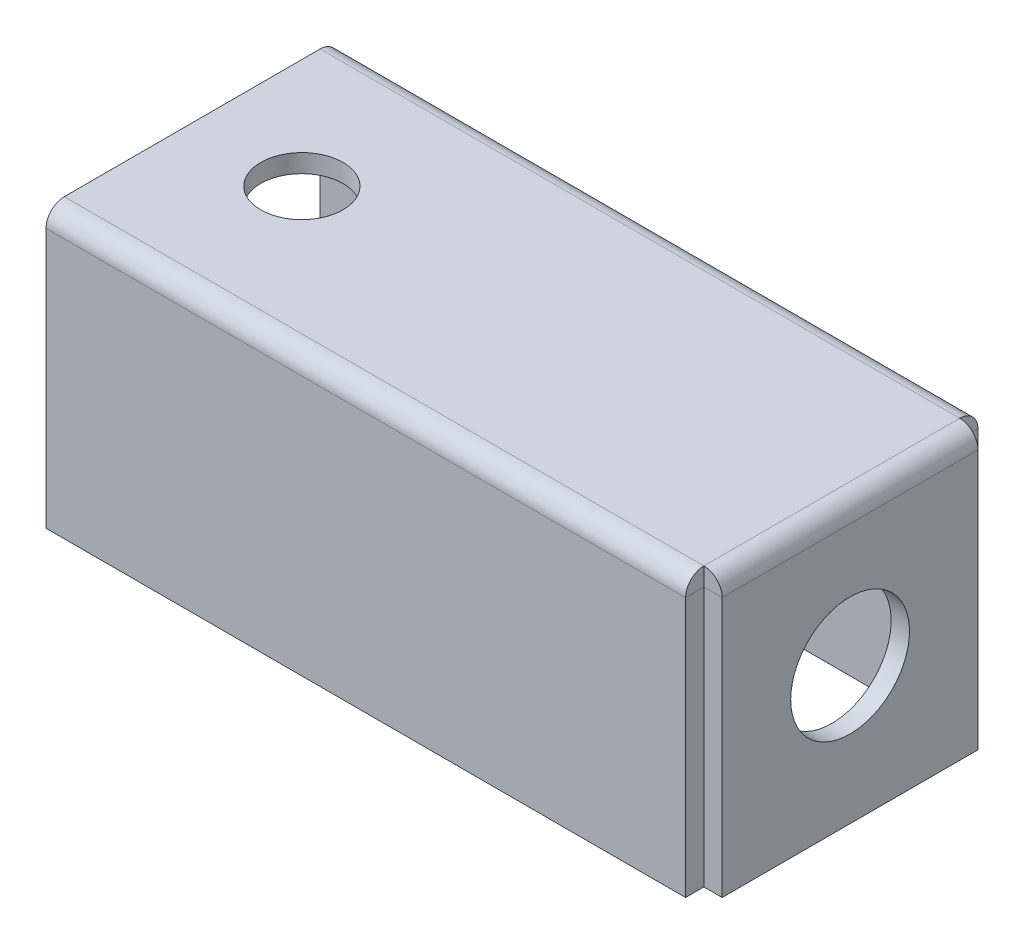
ISO-10303-21;
HEADER;
FILE_DESCRIPTION(('STEP AP214'),'2;1');
FILE_NAME('part.step','',(''),(''),'','','');
FILE_SCHEMA(('AUTOMOTIVE_DESIGN { 1 0 10303 214 1 1 1 1 }'));
ENDSEC;
DATA;
#1=APPLICATION_CONTEXT('core data for automotive mechanical design processes');
#2=APPLICATION_PROTOCOL_DEFINITION('international standard','automotive_design',2000,#1);
#3=PRODUCT_CONTEXT('',#1,'mechanical');
#4=PRODUCT('Part','Part','',(#3));
#5=PRODUCT_RELATED_PRODUCT_CATEGORY('part','',(#4));
#6=PRODUCT_DEFINITION_FORMATION('','',#4);
#7=PRODUCT_DEFINITION_CONTEXT('part definition',#1,'design');
#8=PRODUCT_DEFINITION('design','',#6,#7);
#9=PRODUCT_DEFINITION_SHAPE('','',#8);
#10=(LENGTH_UNIT() NAMED_UNIT(*) SI_UNIT(.MILLI.,.METRE.));
#11=(NAMED_UNIT(*) PLANE_ANGLE_UNIT() SI_UNIT($,.RADIAN.));
#12=(NAMED_UNIT(*) SI_UNIT($,.STERADIAN.) SOLID_ANGLE_UNIT());
#13=UNCERTAINTY_MEASURE_WITH_UNIT(LENGTH_MEASURE(1.E-05),#10,'distance_accuracy_value','');
#14=(GEOMETRIC_REPRESENTATION_CONTEXT(3) GLOBAL_UNCERTAINTY_ASSIGNED_CONTEXT((#13)) GLOBAL_UNIT_ASSIGNED_CONTEXT((#10,
#11,#12)) REPRESENTATION_CONTEXT('',''));
#15=CARTESIAN_POINT('',(0.,0.,0.));
#16=DIRECTION('',(0.,0.,1.));
#17=DIRECTION('',(1.,0.,0.));
#18=AXIS2_PLACEMENT_3D('',#15,#16,#17);
#19=CARTESIAN_POINT('',(0.,-1.,0.));
#20=DIRECTION('',(0.,-1.,0.));
#21=DIRECTION('',(0.,0.,-1.));
#22=AXIS2_PLACEMENT_3D('',#19,#20,#21);
#23=PLANE('',#22);
#24=CARTESIAN_POINT('',(6.,-1.,0.));
#25=DIRECTION('',(0.,1.,0.));
#26=DIRECTION('',(0.,0.,1.));
#27=AXIS2_PLACEMENT_3D('',#24,#25,#26);
#28=CIRCLE('',#27,2.25);
#29=CARTESIAN_POINT('',(6.,-1.,2.25));
#30=VERTEX_POINT('',#29);
#31=EDGE_CURVE('E265',#30,#30,#28,.T.);
#32=ORIENTED_EDGE('',*,*,#31,.T.);
#33=EDGE_LOOP('',(#32));
#34=FACE_BOUND('',#33,.T.);
#35=DIRECTION('',(0.,0.,1.));
#36=VECTOR('',#35,1.);
#37=CARTESIAN_POINT('',(35.,-1.,0.));
#38=LINE('',#37,#36);
#39=CARTESIAN_POINT('',(35.,-1.,-7.));
#40=VERTEX_POINT('',#39);
#41=CARTESIAN_POINT('',(35.,-1.,7.));
#42=VERTEX_POINT('',#41);
#43=EDGE_CURVE('E262',#40,#42,#38,.T.);
#44=ORIENTED_EDGE('',*,*,#43,.T.);
#45=DIRECTION('',(-1.,0.,0.));
#46=VECTOR('',#45,1.);
#47=CARTESIAN_POINT('',(0.,-1.,7.));
#48=LINE('',#47,#46);
#49=CARTESIAN_POINT('',(0.,-1.,7.));
#50=VERTEX_POINT('',#49);
#51=EDGE_CURVE('E322',#42,#50,#48,.T.);
#52=ORIENTED_EDGE('',*,*,#51,.T.);
#53=DIRECTION('',(0.,0.,1.));
#54=VECTOR('',#53,1.);
#55=CARTESIAN_POINT('',(0.,-1.,22.));
#56=LINE('',#55,#54);
#57=CARTESIAN_POINT('',(0.,-1.,-7.));
#58=VERTEX_POINT('',#57);
#59=EDGE_CURVE('E271',#58,#50,#56,.T.);
#60=ORIENTED_EDGE('',*,*,#59,.F.);
#61=DIRECTION('',(-1.,0.,0.));
#62=VECTOR('',#61,1.);
#63=CARTESIAN_POINT('',(0.,-1.,-7.));
#64=LINE('',#63,#62);
#65=EDGE_CURVE('E307',#40,#58,#64,.T.);
#66=ORIENTED_EDGE('',*,*,#65,.F.);
#67=EDGE_LOOP('',(#44,#52,#60,#66));
#68=FACE_BOUND('',#67,.T.);
#69=ADVANCED_FACE('F48',(#34,#68),#23,.T.);
#70=CARTESIAN_POINT('',(0.,-1.,22.));
#71=DIRECTION('',(-1.,0.,0.));
#72=DIRECTION('',(0.,0.,1.));
#73=AXIS2_PLACEMENT_3D('',#70,#71,#72);
#74=PLANE('',#73);
#75=ORIENTED_EDGE('',*,*,#59,.T.);
#76=DIRECTION('',(0.,1.,0.));
#77=VECTOR('',#76,1.);
#78=CARTESIAN_POINT('',(0.,-1.,7.));
#79=LINE('',#78,#77);
#80=CARTESIAN_POINT('',(0.,0.,7.));
#81=VERTEX_POINT('',#80);
#82=EDGE_CURVE('E12',#50,#81,#79,.T.);
#83=ORIENTED_EDGE('',*,*,#82,.T.);
#84=DIRECTION('',(0.,0.,1.));
#85=VECTOR('',#84,1.);
#86=CARTESIAN_POINT('',(0.,0.,22.));
#87=LINE('',#86,#85);
#88=CARTESIAN_POINT('',(0.,0.,-7.));
#89=VERTEX_POINT('',#88);
#90=EDGE_CURVE('E52',#89,#81,#87,.T.);
#91=ORIENTED_EDGE('',*,*,#90,.F.);
#92=DIRECTION('',(0.,1.,0.));
#93=VECTOR('',#92,1.);
#94=CARTESIAN_POINT('',(0.,-1.,-7.));
#95=LINE('',#94,#93);
#96=EDGE_CURVE('E314',#58,#89,#95,.T.);
#97=ORIENTED_EDGE('',*,*,#96,.F.);
#98=EDGE_LOOP('',(#75,#83,#91,#97));
#99=FACE_BOUND('',#98,.T.);
#100=ADVANCED_FACE('F50',(#99),#74,.T.);
#101=CARTESIAN_POINT('',(0.,0.,0.));
#102=DIRECTION('',(0.,-1.,0.));
#103=DIRECTION('',(0.,0.,-1.));
#104=AXIS2_PLACEMENT_3D('',#101,#102,#103);
#105=PLANE('',#104);
#106=DIRECTION('',(-1.,0.,0.));
#107=VECTOR('',#106,1.);
#108=CARTESIAN_POINT('',(0.,0.,7.));
#109=LINE('',#108,#107);
#110=CARTESIAN_POINT('',(35.,0.,7.));
#111=VERTEX_POINT('',#110);
#112=EDGE_CURVE('E57',#111,#81,#109,.T.);
#113=ORIENTED_EDGE('',*,*,#112,.F.);
#114=DIRECTION('',(0.,0.,1.));
#115=VECTOR('',#114,1.);
#116=CARTESIAN_POINT('',(35.,0.,0.));
#117=LINE('',#116,#115);
#118=CARTESIAN_POINT('',(35.,0.,-7.));
#119=VERTEX_POINT('',#118);
#120=EDGE_CURVE('E257',#119,#111,#117,.T.);
#121=ORIENTED_EDGE('',*,*,#120,.F.);
#122=DIRECTION('',(-1.,0.,0.));
#123=VECTOR('',#122,1.);
#124=CARTESIAN_POINT('',(0.,0.,-7.));
#125=LINE('',#124,#123);
#126=EDGE_CURVE('E316',#119,#89,#125,.T.);
#127=ORIENTED_EDGE('',*,*,#126,.T.);
#128=ORIENTED_EDGE('',*,*,#90,.T.);
#129=EDGE_LOOP('',(#113,#121,#127,#128));
#130=FACE_BOUND('',#129,.T.);
#131=CARTESIAN_POINT('',(6.,0.,0.));
#132=DIRECTION('',(0.,1.,0.));
#133=DIRECTION('',(0.,0.,1.));
#134=AXIS2_PLACEMENT_3D('',#131,#132,#133);
#135=CIRCLE('',#134,2.25);
#136=CARTESIAN_POINT('',(6.,0.,2.25));
#137=VERTEX_POINT('',#136);
#138=EDGE_CURVE('E268',#137,#137,#135,.T.);
#139=ORIENTED_EDGE('',*,*,#138,.F.);
#140=EDGE_LOOP('',(#139));
#141=FACE_BOUND('',#140,.T.);
#142=ADVANCED_FACE('F345',(#130,#141),#105,.F.);
#143=CARTESIAN_POINT('',(36.0010000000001,34.7859689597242,0.));
#144=DIRECTION('',(-1.,0.,0.));
#145=DIRECTION('',(0.,0.,-1.));
#146=AXIS2_PLACEMENT_3D('',#143,#144,#145);
#147=PLANE('',#146);
#148=CARTESIAN_POINT('',(36.001,-7.71403104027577,0.));
#149=DIRECTION('',(1.,0.,0.));
#150=DIRECTION('',(0.,0.,1.));
#151=AXIS2_PLACEMENT_3D('',#148,#149,#150);
#152=CIRCLE('',#151,3.25);
#153=CARTESIAN_POINT('',(36.001,-7.71403104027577,3.25));
#154=VERTEX_POINT('',#153);
#155=EDGE_CURVE('E278',#154,#154,#152,.T.);
#156=ORIENTED_EDGE('',*,*,#155,.F.);
#157=EDGE_LOOP('',(#156));
#158=FACE_BOUND('',#157,.T.);
#159=DIRECTION('',(0.,1.,0.));
#160=VECTOR('',#159,1.);
#161=CARTESIAN_POINT('',(36.001,-0.214031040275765,-7.));
#162=LINE('',#161,#160);
#163=CARTESIAN_POINT('',(36.001,-15.2140310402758,-7.));
#164=VERTEX_POINT('',#163);
#165=CARTESIAN_POINT('',(36.001,-1.00100000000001,-7.));
#166=VERTEX_POINT('',#165);
#167=EDGE_CURVE('E289',#164,#166,#162,.T.);
#168=ORIENTED_EDGE('',*,*,#167,.T.);
#169=DIRECTION('',(0.,0.,1.));
#170=VECTOR('',#169,1.);
#171=CARTESIAN_POINT('',(36.001,-1.00100000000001,0.));
#172=LINE('',#171,#170);
#173=CARTESIAN_POINT('',(36.001,-1.00100000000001,7.));
#174=VERTEX_POINT('',#173);
#175=EDGE_CURVE('E301',#166,#174,#172,.T.);
#176=ORIENTED_EDGE('',*,*,#175,.T.);
#177=DIRECTION('',(0.,-1.,0.));
#178=VECTOR('',#177,1.);
#179=CARTESIAN_POINT('',(36.001,-0.214031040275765,7.));
#180=LINE('',#179,#178);
#181=CARTESIAN_POINT('',(36.001,-15.2140310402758,7.));
#182=VERTEX_POINT('',#181);
#183=EDGE_CURVE('E277',#174,#182,#180,.T.);
#184=ORIENTED_EDGE('',*,*,#183,.T.);
#185=DIRECTION('',(0.,0.,-1.));
#186=VECTOR('',#185,1.);
#187=CARTESIAN_POINT('',(36.001,-15.2140310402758,-7.));
#188=LINE('',#187,#186);
#189=EDGE_CURVE('E286',#182,#164,#188,.T.);
#190=ORIENTED_EDGE('',*,*,#189,.T.);
#191=EDGE_LOOP('',(#168,#176,#184,#190));
#192=FACE_BOUND('',#191,.T.);
#193=ADVANCED_FACE('F407',(#158,#192),#147,.F.);
#194=CARTESIAN_POINT('',(35.001,-0.214031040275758,-7.));
#195=DIRECTION('',(0.,0.,-1.));
#196=DIRECTION('',(0.,1.,0.));
#197=AXIS2_PLACEMENT_3D('',#194,#195,#196);
#198=PLANE('',#197);
#199=DIRECTION('',(-1.,0.,0.));
#200=VECTOR('',#199,1.);
#201=CARTESIAN_POINT('',(35.001,-1.001,-7.));
#202=LINE('',#201,#200);
#203=CARTESIAN_POINT('',(35.001,-1.001,-7.));
#204=VERTEX_POINT('',#203);
#205=EDGE_CURVE('E304',#166,#204,#202,.T.);
#206=ORIENTED_EDGE('',*,*,#205,.F.);
#207=ORIENTED_EDGE('',*,*,#167,.F.);
#208=DIRECTION('',(1.,0.,0.));
#209=VECTOR('',#208,1.);
#210=CARTESIAN_POINT('',(35.001,-15.2140310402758,-7.));
#211=LINE('',#210,#209);
#212=CARTESIAN_POINT('',(35.001,-15.2140310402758,-7.));
#213=VERTEX_POINT('',#212);
#214=EDGE_CURVE('E290',#213,#164,#211,.T.);
#215=ORIENTED_EDGE('',*,*,#214,.F.);
#216=DIRECTION('',(0.,1.,0.));
#217=VECTOR('',#216,1.);
#218=CARTESIAN_POINT('',(35.001,-0.214031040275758,-7.));
#219=LINE('',#218,#217);
#220=EDGE_CURVE('E284',#213,#204,#219,.T.);
#221=ORIENTED_EDGE('',*,*,#220,.T.);
#222=EDGE_LOOP('',(#206,#207,#215,#221));
#223=FACE_BOUND('',#222,.T.);
#224=ADVANCED_FACE('F404',(#223),#198,.T.);
#225=CARTESIAN_POINT('',(35.001,-15.2140310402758,-7.));
#226=DIRECTION('',(0.,-1.,0.));
#227=DIRECTION('',(0.,0.,-1.));
#228=AXIS2_PLACEMENT_3D('',#225,#226,#227);
#229=PLANE('',#228);
#230=ORIENTED_EDGE('',*,*,#189,.F.);
#231=DIRECTION('',(1.,0.,0.));
#232=VECTOR('',#231,1.);
#233=CARTESIAN_POINT('',(35.001,-15.2140310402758,7.));
#234=LINE('',#233,#232);
#235=CARTESIAN_POINT('',(35.001,-15.2140310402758,7.));
#236=VERTEX_POINT('',#235);
#237=EDGE_CURVE('E293',#236,#182,#234,.T.);
#238=ORIENTED_EDGE('',*,*,#237,.F.);
#239=DIRECTION('',(0.,0.,-1.));
#240=VECTOR('',#239,1.);
#241=CARTESIAN_POINT('',(35.001,-15.2140310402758,-7.));
#242=LINE('',#241,#240);
#243=EDGE_CURVE('E281',#236,#213,#242,.T.);
#244=ORIENTED_EDGE('',*,*,#243,.T.);
#245=ORIENTED_EDGE('',*,*,#214,.T.);
#246=EDGE_LOOP('',(#230,#238,#244,#245));
#247=FACE_BOUND('',#246,.T.);
#248=ADVANCED_FACE('F415',(#247),#229,.T.);
#249=CARTESIAN_POINT('',(35.001,-0.214031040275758,7.));
#250=DIRECTION('',(0.,0.,1.));
#251=DIRECTION('',(0.,-1.,0.));
#252=AXIS2_PLACEMENT_3D('',#249,#250,#251);
#253=PLANE('',#252);
#254=DIRECTION('',(1.,0.,0.));
#255=VECTOR('',#254,1.);
#256=CARTESIAN_POINT('',(35.001,-1.001,7.));
#257=LINE('',#256,#255);
#258=CARTESIAN_POINT('',(35.001,-1.001,7.));
#259=VERTEX_POINT('',#258);
#260=EDGE_CURVE('E298',#259,#174,#257,.T.);
#261=ORIENTED_EDGE('',*,*,#260,.F.);
#262=DIRECTION('',(0.,-1.,0.));
#263=VECTOR('',#262,1.);
#264=CARTESIAN_POINT('',(35.001,-0.214031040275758,7.));
#265=LINE('',#264,#263);
#266=EDGE_CURVE('E285',#259,#236,#265,.T.);
#267=ORIENTED_EDGE('',*,*,#266,.T.);
#268=ORIENTED_EDGE('',*,*,#237,.T.);
#269=ORIENTED_EDGE('',*,*,#183,.F.);
#270=EDGE_LOOP('',(#261,#267,#268,#269));
#271=FACE_BOUND('',#270,.T.);
#272=ADVANCED_FACE('F420',(#271),#253,.T.);
#273=CARTESIAN_POINT('',(35.0010000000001,34.7859689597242,0.));
#274=DIRECTION('',(-1.,0.,0.));
#275=DIRECTION('',(0.,0.,-1.));
#276=AXIS2_PLACEMENT_3D('',#273,#274,#275);
#277=PLANE('',#276);
#278=DIRECTION('',(0.,0.,1.));
#279=VECTOR('',#278,1.);
#280=CARTESIAN_POINT('',(35.001,-1.001,0.));
#281=LINE('',#280,#279);
#282=EDGE_CURVE('E292',#204,#259,#281,.T.);
#283=ORIENTED_EDGE('',*,*,#282,.F.);
#284=ORIENTED_EDGE('',*,*,#220,.F.);
#285=ORIENTED_EDGE('',*,*,#243,.F.);
#286=ORIENTED_EDGE('',*,*,#266,.F.);
#287=EDGE_LOOP('',(#283,#284,#285,#286));
#288=FACE_BOUND('',#287,.T.);
#289=CARTESIAN_POINT('',(35.001,-7.71403104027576,0.));
#290=DIRECTION('',(1.,0.,0.));
#291=DIRECTION('',(0.,0.,1.));
#292=AXIS2_PLACEMENT_3D('',#289,#290,#291);
#293=CIRCLE('',#292,3.25);
#294=CARTESIAN_POINT('',(35.001,-7.71403104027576,3.25));
#295=VERTEX_POINT('',#294);
#296=EDGE_CURVE('E274',#295,#295,#293,.T.);
#297=ORIENTED_EDGE('',*,*,#296,.T.);
#298=EDGE_LOOP('',(#297));
#299=FACE_BOUND('',#298,.T.);
#300=ADVANCED_FACE('F423',(#288,#299),#277,.T.);
#301=CARTESIAN_POINT('',(35.001,-7.71403104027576,0.));
#302=DIRECTION('',(1.,0.,0.));
#303=DIRECTION('',(0.,0.,1.));
#304=AXIS2_PLACEMENT_3D('',#301,#302,#303);
#305=CYLINDRICAL_SURFACE('',#304,3.25);
#306=ORIENTED_EDGE('',*,*,#296,.F.);
#307=EDGE_LOOP('',(#306));
#308=FACE_BOUND('',#307,.T.);
#309=ORIENTED_EDGE('',*,*,#155,.T.);
#310=EDGE_LOOP('',(#309));
#311=FACE_BOUND('',#310,.T.);
#312=ADVANCED_FACE('F427',(#308,#311),#305,.F.);
#313=CARTESIAN_POINT('',(6.,-1.,0.));
#314=DIRECTION('',(0.,1.,0.));
#315=DIRECTION('',(0.,0.,1.));
#316=AXIS2_PLACEMENT_3D('',#313,#314,#315);
#317=CYLINDRICAL_SURFACE('',#316,2.25);
#318=ORIENTED_EDGE('',*,*,#31,.F.);
#319=EDGE_LOOP('',(#318));
#320=FACE_BOUND('',#319,.T.);
#321=ORIENTED_EDGE('',*,*,#138,.T.);
#322=EDGE_LOOP('',(#321));
#323=FACE_BOUND('',#322,.T.);
#324=ADVANCED_FACE('F434',(#320,#323),#317,.F.);
#325=CARTESIAN_POINT('',(35.,-1.001,-7.));
#326=DIRECTION('',(0.,0.,1.));
#327=DIRECTION('',(1.,0.,0.));
#328=AXIS2_PLACEMENT_3D('',#325,#326,#327);
#329=PLANE('',#328);
#330=DIRECTION('',(0.,1.,0.));
#331=VECTOR('',#330,1.);
#332=CARTESIAN_POINT('',(35.,-1.,-7.));
#333=LINE('',#332,#331);
#334=EDGE_CURVE('E319',#40,#119,#333,.T.);
#335=ORIENTED_EDGE('',*,*,#334,.T.);
#336=CARTESIAN_POINT('',(35.,-1.001,-7.));
#337=DIRECTION('',(0.,0.,1.));
#338=DIRECTION('',(1.,0.,0.));
#339=AXIS2_PLACEMENT_3D('',#336,#337,#338);
#340=CIRCLE('',#339,1.001);
#341=EDGE_CURVE('E246',#119,#166,#340,.F.);
#342=ORIENTED_EDGE('',*,*,#341,.T.);
#343=ORIENTED_EDGE('',*,*,#205,.T.);
#344=CARTESIAN_POINT('',(35.,-1.001,-7.));
#345=DIRECTION('',(0.,0.,-1.));
#346=DIRECTION('',(1.,0.,0.));
#347=AXIS2_PLACEMENT_3D('',#344,#345,#346);
#348=CIRCLE('',#347,0.00100000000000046);
#349=EDGE_CURVE('E250',#40,#204,#348,.T.);
#350=ORIENTED_EDGE('',*,*,#349,.F.);
#351=EDGE_LOOP('',(#335,#342,#343,#350));
#352=FACE_BOUND('',#351,.T.);
#353=ADVANCED_FACE('F363',(#352),#329,.F.);
#354=CARTESIAN_POINT('',(35.,-1.001,7.));
#355=DIRECTION('',(0.,0.,-1.));
#356=DIRECTION('',(-1.,0.,0.));
#357=AXIS2_PLACEMENT_3D('',#354,#355,#356);
#358=PLANE('',#357);
#359=ORIENTED_EDGE('',*,*,#260,.T.);
#360=CARTESIAN_POINT('',(35.,-1.001,7.));
#361=DIRECTION('',(0.,0.,1.));
#362=DIRECTION('',(1.,0.,0.));
#363=AXIS2_PLACEMENT_3D('',#360,#361,#362);
#364=CIRCLE('',#363,1.001);
#365=EDGE_CURVE('E254',#174,#111,#364,.T.);
#366=ORIENTED_EDGE('',*,*,#365,.T.);
#367=DIRECTION('',(0.,1.,0.));
#368=VECTOR('',#367,1.);
#369=CARTESIAN_POINT('',(35.,-1.,7.));
#370=LINE('',#369,#368);
#371=EDGE_CURVE('E325',#42,#111,#370,.T.);
#372=ORIENTED_EDGE('',*,*,#371,.F.);
#373=CARTESIAN_POINT('',(35.,-1.001,7.));
#374=DIRECTION('',(0.,0.,1.));
#375=DIRECTION('',(-1.,0.,0.));
#376=AXIS2_PLACEMENT_3D('',#373,#374,#375);
#377=CIRCLE('',#376,0.00100000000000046);
#378=EDGE_CURVE('E253',#259,#42,#377,.T.);
#379=ORIENTED_EDGE('',*,*,#378,.F.);
#380=EDGE_LOOP('',(#359,#366,#372,#379));
#381=FACE_BOUND('',#380,.T.);
#382=ADVANCED_FACE('F370',(#381),#358,.F.);
#383=CARTESIAN_POINT('',(35.,-1.001,-14.0577139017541));
#384=DIRECTION('',(0.,0.,1.));
#385=DIRECTION('',(1.,0.,0.));
#386=AXIS2_PLACEMENT_3D('',#383,#384,#385);
#387=CYLINDRICAL_SURFACE('',#386,0.001);
#388=ORIENTED_EDGE('',*,*,#378,.T.);
#389=ORIENTED_EDGE('',*,*,#43,.F.);
#390=ORIENTED_EDGE('',*,*,#349,.T.);
#391=ORIENTED_EDGE('',*,*,#282,.T.);
#392=EDGE_LOOP('',(#388,#389,#390,#391));
#393=FACE_BOUND('',#392,.T.);
#394=ADVANCED_FACE('F366',(#393),#387,.F.);
#395=CARTESIAN_POINT('',(35.,-1.001,-14.0577139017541));
#396=DIRECTION('',(0.,0.,1.));
#397=DIRECTION('',(1.,0.,0.));
#398=AXIS2_PLACEMENT_3D('',#395,#396,#397);
#399=CYLINDRICAL_SURFACE('',#398,1.001);
#400=ORIENTED_EDGE('',*,*,#365,.F.);
#401=ORIENTED_EDGE('',*,*,#175,.F.);
#402=ORIENTED_EDGE('',*,*,#341,.F.);
#403=ORIENTED_EDGE('',*,*,#120,.T.);
#404=EDGE_LOOP('',(#400,#401,#402,#403));
#405=FACE_BOUND('',#404,.T.);
#406=ADVANCED_FACE('F443',(#405),#399,.T.);
#407=CARTESIAN_POINT('',(35.,-1.001,-7.));
#408=DIRECTION('',(-1.,0.,0.));
#409=DIRECTION('',(0.,0.,1.));
#410=AXIS2_PLACEMENT_3D('',#407,#408,#409);
#411=PLANE('',#410);
#412=DIRECTION('',(0.,0.,1.));
#413=VECTOR('',#412,1.);
#414=CARTESIAN_POINT('',(35.,-1.001,-7.001));
#415=LINE('',#414,#413);
#416=CARTESIAN_POINT('',(35.,-1.001,-8.001));
#417=VERTEX_POINT('',#416);
#418=CARTESIAN_POINT('',(35.,-1.001,-7.001));
#419=VERTEX_POINT('',#418);
#420=EDGE_CURVE('E215',#417,#419,#415,.T.);
#421=ORIENTED_EDGE('',*,*,#420,.F.);
#422=CARTESIAN_POINT('',(35.,-1.001,-7.));
#423=DIRECTION('',(1.,0.,0.));
#424=DIRECTION('',(0.,0.,-1.));
#425=AXIS2_PLACEMENT_3D('',#422,#423,#424);
#426=CIRCLE('',#425,1.001);
#427=EDGE_CURVE('E72',#417,#119,#426,.T.);
#428=ORIENTED_EDGE('',*,*,#427,.T.);
#429=ORIENTED_EDGE('',*,*,#334,.F.);
#430=CARTESIAN_POINT('',(35.,-1.001,-7.));
#431=DIRECTION('',(1.,0.,0.));
#432=DIRECTION('',(0.,0.,1.));
#433=AXIS2_PLACEMENT_3D('',#430,#431,#432);
#434=CIRCLE('',#433,0.00100000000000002);
#435=EDGE_CURVE('E239',#419,#40,#434,.T.);
#436=ORIENTED_EDGE('',*,*,#435,.F.);
#437=EDGE_LOOP('',(#421,#428,#429,#436));
#438=FACE_BOUND('',#437,.T.);
#439=ADVANCED_FACE('F361',(#438),#411,.F.);
#440=CARTESIAN_POINT('',(0.,-1.001,-7.));
#441=DIRECTION('',(1.,0.,0.));
#442=DIRECTION('',(0.,0.,-1.));
#443=AXIS2_PLACEMENT_3D('',#440,#441,#442);
#444=PLANE('',#443);
#445=CARTESIAN_POINT('',(0.,-1.001,-7.));
#446=DIRECTION('',(1.,0.,0.));
#447=DIRECTION('',(0.,0.,-1.));
#448=AXIS2_PLACEMENT_3D('',#445,#446,#447);
#449=CIRCLE('',#448,1.001);
#450=CARTESIAN_POINT('',(0.,-1.001,-8.001));
#451=VERTEX_POINT('',#450);
#452=EDGE_CURVE('E243',#89,#451,#449,.F.);
#453=ORIENTED_EDGE('',*,*,#452,.T.);
#454=DIRECTION('',(0.,0.,-1.));
#455=VECTOR('',#454,1.);
#456=CARTESIAN_POINT('',(0.,-1.001,-7.001));
#457=LINE('',#456,#455);
#458=CARTESIAN_POINT('',(0.,-1.001,-7.001));
#459=VERTEX_POINT('',#458);
#460=EDGE_CURVE('E224',#459,#451,#457,.T.);
#461=ORIENTED_EDGE('',*,*,#460,.F.);
#462=CARTESIAN_POINT('',(0.,-1.001,-7.));
#463=DIRECTION('',(-1.,0.,0.));
#464=DIRECTION('',(0.,0.,-1.));
#465=AXIS2_PLACEMENT_3D('',#462,#463,#464);
#466=CIRCLE('',#465,0.00100000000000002);
#467=EDGE_CURVE('E242',#58,#459,#466,.T.);
#468=ORIENTED_EDGE('',*,*,#467,.F.);
#469=ORIENTED_EDGE('',*,*,#96,.T.);
#470=EDGE_LOOP('',(#453,#461,#468,#469));
#471=FACE_BOUND('',#470,.T.);
#472=ADVANCED_FACE('F355',(#471),#444,.F.);
#473=CARTESIAN_POINT('',(-17.5231255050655,-1.001,-7.));
#474=DIRECTION('',(1.,0.,0.));
#475=DIRECTION('',(0.,0.,-1.));
#476=AXIS2_PLACEMENT_3D('',#473,#474,#475);
#477=CYLINDRICAL_SURFACE('',#476,0.001);
#478=ORIENTED_EDGE('',*,*,#65,.T.);
#479=ORIENTED_EDGE('',*,*,#467,.T.);
#480=DIRECTION('',(-1.,0.,0.));
#481=VECTOR('',#480,1.);
#482=CARTESIAN_POINT('',(0.,-1.001,-7.001));
#483=LINE('',#482,#481);
#484=EDGE_CURVE('E230',#419,#459,#483,.T.);
#485=ORIENTED_EDGE('',*,*,#484,.F.);
#486=ORIENTED_EDGE('',*,*,#435,.T.);
#487=EDGE_LOOP('',(#478,#479,#485,#486));
#488=FACE_BOUND('',#487,.T.);
#489=ADVANCED_FACE('F359',(#488),#477,.F.);
#490=CARTESIAN_POINT('',(-17.5231255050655,-1.001,-7.));
#491=DIRECTION('',(1.,0.,0.));
#492=DIRECTION('',(0.,0.,-1.));
#493=AXIS2_PLACEMENT_3D('',#490,#491,#492);
#494=CYLINDRICAL_SURFACE('',#493,1.001);
#495=ORIENTED_EDGE('',*,*,#126,.F.);
#496=ORIENTED_EDGE('',*,*,#427,.F.);
#497=DIRECTION('',(-1.,0.,0.));
#498=VECTOR('',#497,1.);
#499=CARTESIAN_POINT('',(0.,-1.001,-8.001));
#500=LINE('',#499,#498);
#501=EDGE_CURVE('E206',#417,#451,#500,.T.);
#502=ORIENTED_EDGE('',*,*,#501,.T.);
#503=ORIENTED_EDGE('',*,*,#452,.F.);
#504=EDGE_LOOP('',(#495,#496,#502,#503));
#505=FACE_BOUND('',#504,.T.);
#506=ADVANCED_FACE('F351',(#505),#494,.T.);
#507=CARTESIAN_POINT('',(0.,-15.2140310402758,-7.00099999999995));
#508=DIRECTION('',(0.,-1.,0.));
#509=DIRECTION('',(-1.,0.,0.));
#510=AXIS2_PLACEMENT_3D('',#507,#508,#509);
#511=PLANE('',#510);
#512=DIRECTION('',(-1.,0.,0.));
#513=VECTOR('',#512,1.);
#514=CARTESIAN_POINT('',(0.,-15.2140310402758,-8.00099999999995));
#515=LINE('',#514,#513);
#516=CARTESIAN_POINT('',(35.,-15.2140310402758,-8.00099999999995));
#517=VERTEX_POINT('',#516);
#518=CARTESIAN_POINT('',(0.,-15.2140310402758,-8.00099999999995));
#519=VERTEX_POINT('',#518);
#520=EDGE_CURVE('E219',#517,#519,#515,.T.);
#521=ORIENTED_EDGE('',*,*,#520,.F.);
#522=DIRECTION('',(0.,0.,-1.));
#523=VECTOR('',#522,1.);
#524=CARTESIAN_POINT('',(35.,-15.2140310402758,-7.00099999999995));
#525=LINE('',#524,#523);
#526=CARTESIAN_POINT('',(35.,-15.2140310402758,-7.00099999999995));
#527=VERTEX_POINT('',#526);
#528=EDGE_CURVE('E210',#527,#517,#525,.T.);
#529=ORIENTED_EDGE('',*,*,#528,.F.);
#530=DIRECTION('',(-1.,0.,0.));
#531=VECTOR('',#530,1.);
#532=CARTESIAN_POINT('',(0.,-15.2140310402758,-7.00099999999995));
#533=LINE('',#532,#531);
#534=CARTESIAN_POINT('',(0.,-15.2140310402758,-7.00099999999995));
#535=VERTEX_POINT('',#534);
#536=EDGE_CURVE('E234',#527,#535,#533,.T.);
#537=ORIENTED_EDGE('',*,*,#536,.T.);
#538=DIRECTION('',(0.,0.,-1.));
#539=VECTOR('',#538,1.);
#540=CARTESIAN_POINT('',(0.,-15.2140310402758,-7.00099999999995));
#541=LINE('',#540,#539);
#542=EDGE_CURVE('E232',#535,#519,#541,.T.);
#543=ORIENTED_EDGE('',*,*,#542,.T.);
#544=EDGE_LOOP('',(#521,#529,#537,#543));
#545=FACE_BOUND('',#544,.T.);
#546=ADVANCED_FACE('F455',(#545),#511,.T.);
#547=CARTESIAN_POINT('',(0.,6.78596895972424,-7.00100000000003));
#548=DIRECTION('',(0.,0.,1.));
#549=DIRECTION('',(0.,-1.,0.));
#550=AXIS2_PLACEMENT_3D('',#547,#548,#549);
#551=PLANE('',#550);
#552=DIRECTION('',(0.,-1.,0.));
#553=VECTOR('',#552,1.);
#554=CARTESIAN_POINT('',(35.,-15.2140310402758,-7.00099999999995));
#555=LINE('',#554,#553);
#556=EDGE_CURVE('E213',#419,#527,#555,.T.);
#557=ORIENTED_EDGE('',*,*,#556,.F.);
#558=ORIENTED_EDGE('',*,*,#484,.T.);
#559=DIRECTION('',(0.,1.,0.));
#560=VECTOR('',#559,1.);
#561=CARTESIAN_POINT('',(0.,28.7859689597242,-7.0010000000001));
#562=LINE('',#561,#560);
#563=EDGE_CURVE('E227',#535,#459,#562,.T.);
#564=ORIENTED_EDGE('',*,*,#563,.F.);
#565=ORIENTED_EDGE('',*,*,#536,.F.);
#566=EDGE_LOOP('',(#557,#558,#564,#565));
#567=FACE_BOUND('',#566,.T.);
#568=ADVANCED_FACE('F469',(#567),#551,.T.);
#569=CARTESIAN_POINT('',(0.,28.7859689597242,-7.0010000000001));
#570=DIRECTION('',(-1.,0.,0.));
#571=DIRECTION('',(0.,1.,0.));
#572=AXIS2_PLACEMENT_3D('',#569,#570,#571);
#573=PLANE('',#572);
#574=ORIENTED_EDGE('',*,*,#563,.T.);
#575=ORIENTED_EDGE('',*,*,#460,.T.);
#576=DIRECTION('',(0.,1.,0.));
#577=VECTOR('',#576,1.);
#578=CARTESIAN_POINT('',(0.,28.7859689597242,-8.0010000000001));
#579=LINE('',#578,#577);
#580=EDGE_CURVE('E217',#519,#451,#579,.T.);
#581=ORIENTED_EDGE('',*,*,#580,.F.);
#582=ORIENTED_EDGE('',*,*,#542,.F.);
#583=EDGE_LOOP('',(#574,#575,#581,#582));
#584=FACE_BOUND('',#583,.T.);
#585=ADVANCED_FACE('F465',(#584),#573,.T.);
#586=CARTESIAN_POINT('',(0.,6.78596895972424,-8.00100000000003));
#587=DIRECTION('',(0.,0.,1.));
#588=DIRECTION('',(0.,-1.,0.));
#589=AXIS2_PLACEMENT_3D('',#586,#587,#588);
#590=PLANE('',#589);
#591=ORIENTED_EDGE('',*,*,#501,.F.);
#592=DIRECTION('',(0.,-1.,0.));
#593=VECTOR('',#592,1.);
#594=CARTESIAN_POINT('',(35.,-15.2140310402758,-8.00099999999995));
#595=LINE('',#594,#593);
#596=EDGE_CURVE('E222',#417,#517,#595,.T.);
#597=ORIENTED_EDGE('',*,*,#596,.T.);
#598=ORIENTED_EDGE('',*,*,#520,.T.);
#599=ORIENTED_EDGE('',*,*,#580,.T.);
#600=EDGE_LOOP('',(#591,#597,#598,#599));
#601=FACE_BOUND('',#600,.T.);
#602=ADVANCED_FACE('F461',(#601),#590,.F.);
#603=CARTESIAN_POINT('',(35.,-15.2140310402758,-7.00099999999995));
#604=DIRECTION('',(1.,0.,0.));
#605=DIRECTION('',(0.,-1.,0.));
#606=AXIS2_PLACEMENT_3D('',#603,#604,#605);
#607=PLANE('',#606);
#608=ORIENTED_EDGE('',*,*,#596,.F.);
#609=ORIENTED_EDGE('',*,*,#420,.T.);
#610=ORIENTED_EDGE('',*,*,#556,.T.);
#611=ORIENTED_EDGE('',*,*,#528,.T.);
#612=EDGE_LOOP('',(#608,#609,#610,#611));
#613=FACE_BOUND('',#612,.T.);
#614=ADVANCED_FACE('F458',(#613),#607,.T.);
#615=CARTESIAN_POINT('',(35.,-1.001,7.));
#616=DIRECTION('',(-1.,0.,0.));
#617=DIRECTION('',(0.,0.,1.));
#618=AXIS2_PLACEMENT_3D('',#615,#616,#617);
#619=PLANE('',#618);
#620=ORIENTED_EDGE('',*,*,#371,.T.);
#621=CARTESIAN_POINT('',(35.,-1.001,7.));
#622=DIRECTION('',(-1.,0.,0.));
#623=DIRECTION('',(0.,0.,1.));
#624=AXIS2_PLACEMENT_3D('',#621,#622,#623);
#625=CIRCLE('',#624,1.001);
#626=CARTESIAN_POINT('',(35.,-1.001,8.001));
#627=VERTEX_POINT('',#626);
#628=EDGE_CURVE('E182',#111,#627,#625,.F.);
#629=ORIENTED_EDGE('',*,*,#628,.T.);
#630=DIRECTION('',(0.,0.,-1.));
#631=VECTOR('',#630,1.);
#632=CARTESIAN_POINT('',(35.,-1.001,7.001));
#633=LINE('',#632,#631);
#634=CARTESIAN_POINT('',(35.,-1.001,7.001));
#635=VERTEX_POINT('',#634);
#636=EDGE_CURVE('E189',#627,#635,#633,.T.);
#637=ORIENTED_EDGE('',*,*,#636,.T.);
#638=CARTESIAN_POINT('',(35.,-1.001,7.));
#639=DIRECTION('',(1.,0.,0.));
#640=DIRECTION('',(0.,0.,1.));
#641=AXIS2_PLACEMENT_3D('',#638,#639,#640);
#642=CIRCLE('',#641,0.00100000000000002);
#643=EDGE_CURVE('E199',#42,#635,#642,.T.);
#644=ORIENTED_EDGE('',*,*,#643,.F.);
#645=EDGE_LOOP('',(#620,#629,#637,#644));
#646=FACE_BOUND('',#645,.T.);
#647=ADVANCED_FACE('F373',(#646),#619,.F.);
#648=CARTESIAN_POINT('',(0.,-1.001,7.));
#649=DIRECTION('',(1.,0.,0.));
#650=DIRECTION('',(0.,0.,-1.));
#651=AXIS2_PLACEMENT_3D('',#648,#649,#650);
#652=PLANE('',#651);
#653=DIRECTION('',(0.,0.,1.));
#654=VECTOR('',#653,1.);
#655=CARTESIAN_POINT('',(0.,-1.001,7.001));
#656=LINE('',#655,#654);
#657=CARTESIAN_POINT('',(0.,-1.001,7.001));
#658=VERTEX_POINT('',#657);
#659=CARTESIAN_POINT('',(0.,-1.001,8.001));
#660=VERTEX_POINT('',#659);
#661=EDGE_CURVE('E171',#658,#660,#656,.T.);
#662=ORIENTED_EDGE('',*,*,#661,.T.);
#663=CARTESIAN_POINT('',(0.,-1.001,7.));
#664=DIRECTION('',(-1.,0.,0.));
#665=DIRECTION('',(0.,0.,1.));
#666=AXIS2_PLACEMENT_3D('',#663,#664,#665);
#667=CIRCLE('',#666,1.001);
#668=EDGE_CURVE('E203',#660,#81,#667,.T.);
#669=ORIENTED_EDGE('',*,*,#668,.T.);
#670=ORIENTED_EDGE('',*,*,#82,.F.);
#671=CARTESIAN_POINT('',(0.,-1.001,7.));
#672=DIRECTION('',(-1.,0.,0.));
#673=DIRECTION('',(0.,0.,-1.));
#674=AXIS2_PLACEMENT_3D('',#671,#672,#673);
#675=CIRCLE('',#674,0.00100000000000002);
#676=EDGE_CURVE('E202',#658,#50,#675,.T.);
#677=ORIENTED_EDGE('',*,*,#676,.F.);
#678=EDGE_LOOP('',(#662,#669,#670,#677));
#679=FACE_BOUND('',#678,.T.);
#680=ADVANCED_FACE('F341',(#679),#652,.F.);
#681=CARTESIAN_POINT('',(52.5231255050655,-1.001,7.));
#682=DIRECTION('',(-1.,0.,0.));
#683=DIRECTION('',(0.,0.,1.));
#684=AXIS2_PLACEMENT_3D('',#681,#682,#683);
#685=CYLINDRICAL_SURFACE('',#684,0.001);
#686=ORIENTED_EDGE('',*,*,#676,.T.);
#687=ORIENTED_EDGE('',*,*,#51,.F.);
#688=ORIENTED_EDGE('',*,*,#643,.T.);
#689=DIRECTION('',(-1.,0.,0.));
#690=VECTOR('',#689,1.);
#691=CARTESIAN_POINT('',(0.,-1.001,7.001));
#692=LINE('',#691,#690);
#693=EDGE_CURVE('E197',#635,#658,#692,.T.);
#694=ORIENTED_EDGE('',*,*,#693,.T.);
#695=EDGE_LOOP('',(#686,#687,#688,#694));
#696=FACE_BOUND('',#695,.T.);
#697=ADVANCED_FACE('F338',(#696),#685,.F.);
#698=CARTESIAN_POINT('',(52.5231255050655,-1.001,7.));
#699=DIRECTION('',(-1.,0.,0.));
#700=DIRECTION('',(0.,0.,1.));
#701=AXIS2_PLACEMENT_3D('',#698,#699,#700);
#702=CYLINDRICAL_SURFACE('',#701,1.001);
#703=ORIENTED_EDGE('',*,*,#668,.F.);
#704=DIRECTION('',(-1.,0.,0.));
#705=VECTOR('',#704,1.);
#706=CARTESIAN_POINT('',(0.,-1.001,8.001));
#707=LINE('',#706,#705);
#708=EDGE_CURVE('E376',#627,#660,#707,.T.);
#709=ORIENTED_EDGE('',*,*,#708,.F.);
#710=ORIENTED_EDGE('',*,*,#628,.F.);
#711=ORIENTED_EDGE('',*,*,#112,.T.);
#712=EDGE_LOOP('',(#703,#709,#710,#711));
#713=FACE_BOUND('',#712,.T.);
#714=ADVANCED_FACE('F374',(#713),#702,.T.);
#715=CARTESIAN_POINT('',(0.,-15.2140310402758,7.00099999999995));
#716=DIRECTION('',(0.,-1.,0.));
#717=DIRECTION('',(1.,0.,0.));
#718=AXIS2_PLACEMENT_3D('',#715,#716,#717);
#719=PLANE('',#718);
#720=DIRECTION('',(1.,0.,0.));
#721=VECTOR('',#720,1.);
#722=CARTESIAN_POINT('',(0.,-15.2140310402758,8.00099999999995));
#723=LINE('',#722,#721);
#724=CARTESIAN_POINT('',(0.,-15.2140310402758,8.00099999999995));
#725=VERTEX_POINT('',#724);
#726=CARTESIAN_POINT('',(35.,-15.2140310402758,8.00099999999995));
#727=VERTEX_POINT('',#726);
#728=EDGE_CURVE('E175',#725,#727,#723,.T.);
#729=ORIENTED_EDGE('',*,*,#728,.F.);
#730=DIRECTION('',(0.,0.,1.));
#731=VECTOR('',#730,1.);
#732=CARTESIAN_POINT('',(0.,-15.2140310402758,7.00099999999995));
#733=LINE('',#732,#731);
#734=CARTESIAN_POINT('',(0.,-15.2140310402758,7.00099999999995));
#735=VERTEX_POINT('',#734);
#736=EDGE_CURVE('E168',#735,#725,#733,.T.);
#737=ORIENTED_EDGE('',*,*,#736,.F.);
#738=DIRECTION('',(1.,0.,0.));
#739=VECTOR('',#738,1.);
#740=CARTESIAN_POINT('',(0.,-15.2140310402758,7.00099999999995));
#741=LINE('',#740,#739);
#742=CARTESIAN_POINT('',(35.,-15.2140310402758,7.00099999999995));
#743=VERTEX_POINT('',#742);
#744=EDGE_CURVE('E180',#735,#743,#741,.T.);
#745=ORIENTED_EDGE('',*,*,#744,.T.);
#746=DIRECTION('',(0.,0.,1.));
#747=VECTOR('',#746,1.);
#748=CARTESIAN_POINT('',(35.,-15.2140310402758,7.00099999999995));
#749=LINE('',#748,#747);
#750=EDGE_CURVE('E188',#743,#727,#749,.T.);
#751=ORIENTED_EDGE('',*,*,#750,.T.);
#752=EDGE_LOOP('',(#729,#737,#745,#751));
#753=FACE_BOUND('',#752,.T.);
#754=ADVANCED_FACE('F179',(#753),#719,.T.);
#755=CARTESIAN_POINT('',(0.,6.78596895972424,7.00100000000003));
#756=DIRECTION('',(0.,0.,-1.));
#757=DIRECTION('',(0.,1.,0.));
#758=AXIS2_PLACEMENT_3D('',#755,#756,#757);
#759=PLANE('',#758);
#760=ORIENTED_EDGE('',*,*,#693,.F.);
#761=DIRECTION('',(0.,1.,0.));
#762=VECTOR('',#761,1.);
#763=CARTESIAN_POINT('',(35.,-15.2140310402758,7.00099999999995));
#764=LINE('',#763,#762);
#765=EDGE_CURVE('E187',#743,#635,#764,.T.);
#766=ORIENTED_EDGE('',*,*,#765,.F.);
#767=ORIENTED_EDGE('',*,*,#744,.F.);
#768=DIRECTION('',(0.,-1.,0.));
#769=VECTOR('',#768,1.);
#770=CARTESIAN_POINT('',(0.,-15.2140310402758,7.00099999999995));
#771=LINE('',#770,#769);
#772=EDGE_CURVE('E165',#658,#735,#771,.T.);
#773=ORIENTED_EDGE('',*,*,#772,.F.);
#774=EDGE_LOOP('',(#760,#766,#767,#773));
#775=FACE_BOUND('',#774,.T.);
#776=ADVANCED_FACE('F185',(#775),#759,.T.);
#777=CARTESIAN_POINT('',(35.,-15.2140310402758,7.00099999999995));
#778=DIRECTION('',(1.,0.,0.));
#779=DIRECTION('',(0.,1.,0.));
#780=AXIS2_PLACEMENT_3D('',#777,#778,#779);
#781=PLANE('',#780);
#782=ORIENTED_EDGE('',*,*,#636,.F.);
#783=DIRECTION('',(0.,1.,0.));
#784=VECTOR('',#783,1.);
#785=CARTESIAN_POINT('',(35.,-15.2140310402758,8.00099999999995));
#786=LINE('',#785,#784);
#787=EDGE_CURVE('E379',#727,#627,#786,.T.);
#788=ORIENTED_EDGE('',*,*,#787,.F.);
#789=ORIENTED_EDGE('',*,*,#750,.F.);
#790=ORIENTED_EDGE('',*,*,#765,.T.);
#791=EDGE_LOOP('',(#782,#788,#789,#790));
#792=FACE_BOUND('',#791,.T.);
#793=ADVANCED_FACE('F386',(#792),#781,.T.);
#794=CARTESIAN_POINT('',(0.,6.78596895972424,8.00100000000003));
#795=DIRECTION('',(0.,0.,-1.));
#796=DIRECTION('',(0.,1.,0.));
#797=AXIS2_PLACEMENT_3D('',#794,#795,#796);
#798=PLANE('',#797);
#799=ORIENTED_EDGE('',*,*,#787,.T.);
#800=ORIENTED_EDGE('',*,*,#708,.T.);
#801=DIRECTION('',(0.,-1.,0.));
#802=VECTOR('',#801,1.);
#803=CARTESIAN_POINT('',(0.,-15.2140310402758,8.00099999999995));
#804=LINE('',#803,#802);
#805=EDGE_CURVE('E378',#660,#725,#804,.T.);
#806=ORIENTED_EDGE('',*,*,#805,.T.);
#807=ORIENTED_EDGE('',*,*,#728,.T.);
#808=EDGE_LOOP('',(#799,#800,#806,#807));
#809=FACE_BOUND('',#808,.T.);
#810=ADVANCED_FACE('F388',(#809),#798,.F.);
#811=CARTESIAN_POINT('',(0.,-15.2140310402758,7.00099999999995));
#812=DIRECTION('',(-1.,0.,0.));
#813=DIRECTION('',(0.,-1.,0.));
#814=AXIS2_PLACEMENT_3D('',#811,#812,#813);
#815=PLANE('',#814);
#816=ORIENTED_EDGE('',*,*,#661,.F.);
#817=ORIENTED_EDGE('',*,*,#772,.T.);
#818=ORIENTED_EDGE('',*,*,#736,.T.);
#819=ORIENTED_EDGE('',*,*,#805,.F.);
#820=EDGE_LOOP('',(#816,#817,#818,#819));
#821=FACE_BOUND('',#820,.T.);
#822=ADVANCED_FACE('F167',(#821),#815,.T.);
#823=CLOSED_SHELL('',(#69,#100,#142,#193,#224,#248,#272,#300,#312,#324,#353,#382,#394,#406,#439,
#472,#489,#506,#546,#568,#585,#602,#614,#647,#680,#697,#714,#754,#776,#793,#810,#822));
#824=MANIFOLD_SOLID_BREP('B2',#823);
#825=ADVANCED_BREP_SHAPE_REPRESENTATION('',(#18,#824),#14);
#826=SHAPE_DEFINITION_REPRESENTATION(#9,#825);
ENDSEC;
END-ISO-10303-21;
